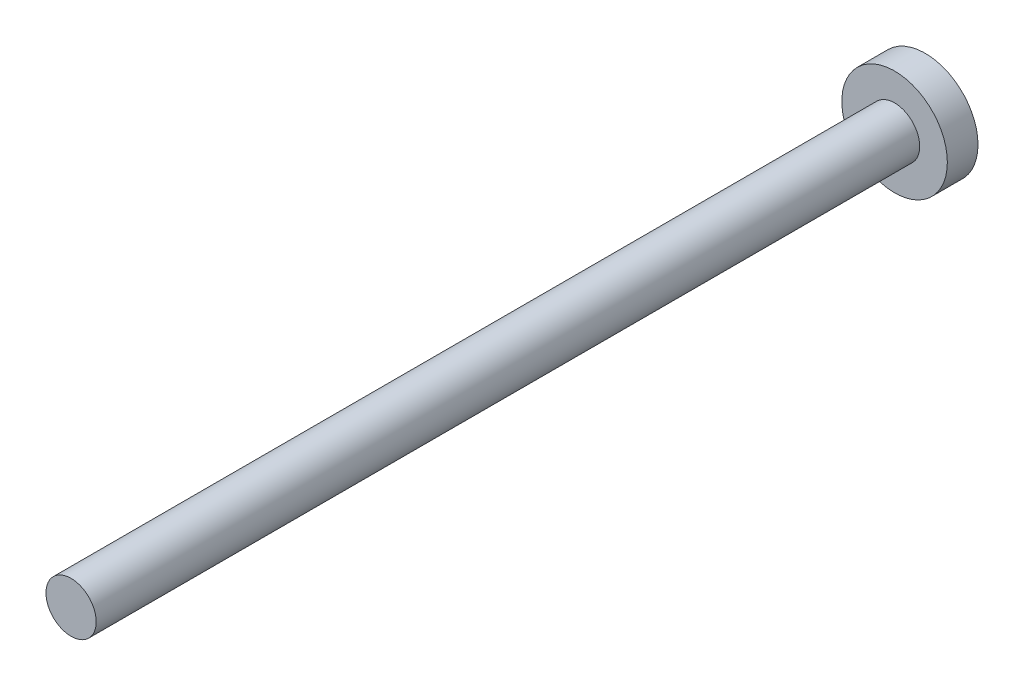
ISO-10303-21;
HEADER;
FILE_DESCRIPTION(('STEP AP214'),'2;1');
FILE_NAME('part.step','',(''),(''),'','','');
FILE_SCHEMA(('AUTOMOTIVE_DESIGN { 1 0 10303 214 1 1 1 1 }'));
ENDSEC;
DATA;
#1=APPLICATION_CONTEXT('core data for automotive mechanical design processes');
#2=APPLICATION_PROTOCOL_DEFINITION('international standard','automotive_design',2000,#1);
#3=PRODUCT_CONTEXT('',#1,'mechanical');
#4=PRODUCT('Part','Part','',(#3));
#5=PRODUCT_RELATED_PRODUCT_CATEGORY('part','',(#4));
#6=PRODUCT_DEFINITION_FORMATION('','',#4);
#7=PRODUCT_DEFINITION_CONTEXT('part definition',#1,'design');
#8=PRODUCT_DEFINITION('design','',#6,#7);
#9=PRODUCT_DEFINITION_SHAPE('','',#8);
#10=(LENGTH_UNIT() NAMED_UNIT(*) SI_UNIT(.MILLI.,.METRE.));
#11=(NAMED_UNIT(*) PLANE_ANGLE_UNIT() SI_UNIT($,.RADIAN.));
#12=(NAMED_UNIT(*) SI_UNIT($,.STERADIAN.) SOLID_ANGLE_UNIT());
#13=UNCERTAINTY_MEASURE_WITH_UNIT(LENGTH_MEASURE(1.E-05),#10,'distance_accuracy_value','');
#14=(GEOMETRIC_REPRESENTATION_CONTEXT(3) GLOBAL_UNCERTAINTY_ASSIGNED_CONTEXT((#13)) GLOBAL_UNIT_ASSIGNED_CONTEXT((#10,
#11,#12)) REPRESENTATION_CONTEXT('',''));
#15=CARTESIAN_POINT('',(0.,0.,0.));
#16=DIRECTION('',(0.,0.,1.));
#17=DIRECTION('',(1.,0.,0.));
#18=AXIS2_PLACEMENT_3D('',#15,#16,#17);
#19=CARTESIAN_POINT('',(6.10622663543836E-12,1.11022302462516E-13,3.05));
#20=DIRECTION('',(0.,0.,1.));
#21=DIRECTION('',(1.,0.,0.));
#22=AXIS2_PLACEMENT_3D('',#19,#20,#21);
#23=PLANE('',#22);
#24=CARTESIAN_POINT('',(6.10622663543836E-12,1.11022302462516E-13,3.05));
#25=DIRECTION('',(0.,0.,1.));
#26=DIRECTION('',(1.,0.,0.));
#27=AXIS2_PLACEMENT_3D('',#24,#25,#26);
#28=CIRCLE('',#27,5.25);
#29=CARTESIAN_POINT('',(5.25000000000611,-1.36404776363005E-13,3.05000000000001));
#30=VERTEX_POINT('',#29);
#31=EDGE_CURVE('E10',#30,#30,#28,.T.);
#32=ORIENTED_EDGE('',*,*,#31,.T.);
#33=EDGE_LOOP('',(#32));
#34=FACE_BOUND('',#33,.T.);
#35=CARTESIAN_POINT('',(6.10622663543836E-12,1.11022302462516E-13,3.05));
#36=DIRECTION('',(0.,0.,1.));
#37=DIRECTION('',(1.,0.,0.));
#38=AXIS2_PLACEMENT_3D('',#35,#36,#37);
#39=CIRCLE('',#38,2.5);
#40=CARTESIAN_POINT('',(2.50000000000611,0.,3.05));
#41=VERTEX_POINT('',#40);
#42=EDGE_CURVE('E52',#41,#41,#39,.T.);
#43=ORIENTED_EDGE('',*,*,#42,.F.);
#44=EDGE_LOOP('',(#43));
#45=FACE_BOUND('',#44,.T.);
#46=ADVANCED_FACE('F37',(#34,#45),#23,.T.);
#47=CARTESIAN_POINT('',(6.10622663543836E-12,1.11022302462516E-13,3.05));
#48=DIRECTION('',(0.,0.,-1.));
#49=DIRECTION('',(-1.,0.,0.));
#50=AXIS2_PLACEMENT_3D('',#47,#48,#49);
#51=CYLINDRICAL_SURFACE('',#50,5.25);
#52=ORIENTED_EDGE('',*,*,#31,.F.);
#53=EDGE_LOOP('',(#52));
#54=FACE_BOUND('',#53,.T.);
#55=CARTESIAN_POINT('',(0.,1.11022302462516E-13,0.));
#56=DIRECTION('',(0.,0.,1.));
#57=DIRECTION('',(1.,0.,0.));
#58=AXIS2_PLACEMENT_3D('',#55,#56,#57);
#59=CIRCLE('',#58,5.25);
#60=CARTESIAN_POINT('',(5.25,-1.36404776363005E-13,0.));
#61=VERTEX_POINT('',#60);
#62=EDGE_CURVE('E44',#61,#61,#59,.T.);
#63=ORIENTED_EDGE('',*,*,#62,.T.);
#64=EDGE_LOOP('',(#63));
#65=FACE_BOUND('',#64,.T.);
#66=ADVANCED_FACE('F39',(#54,#65),#51,.T.);
#67=CARTESIAN_POINT('',(0.,1.11022302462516E-13,0.));
#68=DIRECTION('',(0.,0.,1.));
#69=DIRECTION('',(1.,0.,0.));
#70=AXIS2_PLACEMENT_3D('',#67,#68,#69);
#71=PLANE('',#70);
#72=ORIENTED_EDGE('',*,*,#62,.F.);
#73=EDGE_LOOP('',(#72));
#74=FACE_BOUND('',#73,.T.);
#75=ADVANCED_FACE('F64',(#74),#71,.F.);
#76=CARTESIAN_POINT('',(5.13478148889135E-12,1.52655665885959E-13,85.));
#77=DIRECTION('',(0.,0.,-1.));
#78=DIRECTION('',(-1.,0.,0.));
#79=AXIS2_PLACEMENT_3D('',#76,#77,#78);
#80=CYLINDRICAL_SURFACE('',#79,2.5);
#81=CARTESIAN_POINT('',(5.13478148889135E-12,1.52655665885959E-13,85.));
#82=DIRECTION('',(0.,0.,1.));
#83=DIRECTION('',(1.,0.,0.));
#84=AXIS2_PLACEMENT_3D('',#81,#82,#83);
#85=CIRCLE('',#84,2.5);
#86=CARTESIAN_POINT('',(2.50000000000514,0.,85.));
#87=VERTEX_POINT('',#86);
#88=EDGE_CURVE('E48',#87,#87,#85,.T.);
#89=ORIENTED_EDGE('',*,*,#88,.F.);
#90=EDGE_LOOP('',(#89));
#91=FACE_BOUND('',#90,.T.);
#92=ORIENTED_EDGE('',*,*,#42,.T.);
#93=EDGE_LOOP('',(#92));
#94=FACE_BOUND('',#93,.T.);
#95=ADVANCED_FACE('F58',(#91,#94),#80,.T.);
#96=CARTESIAN_POINT('',(5.13478148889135E-12,1.52655665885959E-13,85.));
#97=DIRECTION('',(0.,0.,1.));
#98=DIRECTION('',(1.,0.,0.));
#99=AXIS2_PLACEMENT_3D('',#96,#97,#98);
#100=PLANE('',#99);
#101=ORIENTED_EDGE('',*,*,#88,.T.);
#102=EDGE_LOOP('',(#101));
#103=FACE_BOUND('',#102,.T.);
#104=ADVANCED_FACE('F72',(#103),#100,.T.);
#105=CLOSED_SHELL('',(#46,#66,#75,#95,#104));
#106=MANIFOLD_SOLID_BREP('B2',#105);
#107=ADVANCED_BREP_SHAPE_REPRESENTATION('',(#18,#106),#14);
#108=SHAPE_DEFINITION_REPRESENTATION(#9,#107);
ENDSEC;
END-ISO-10303-21;
